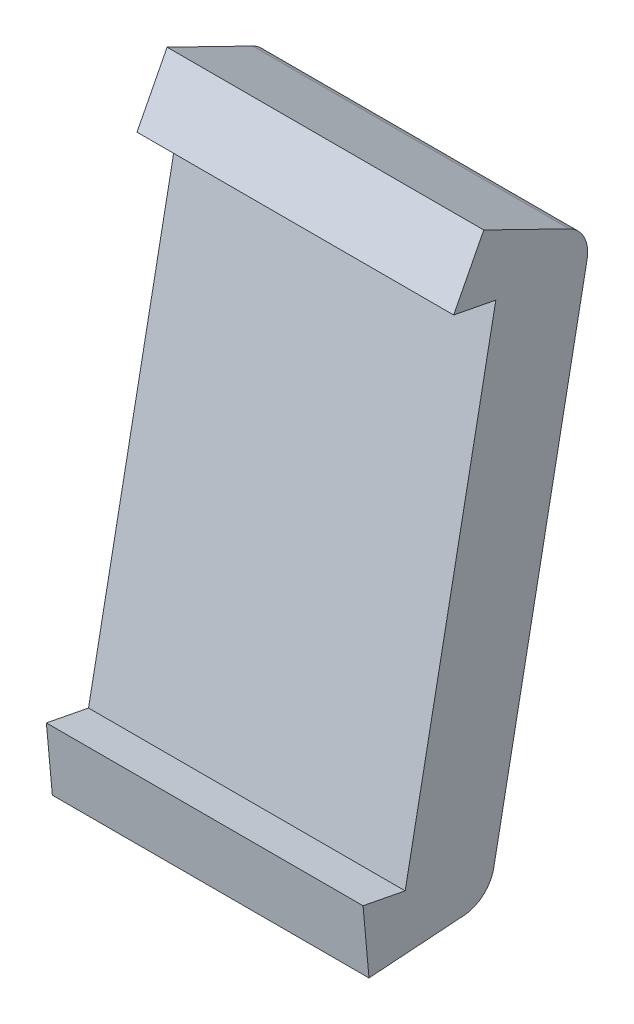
ISO-10303-21;
HEADER;
FILE_DESCRIPTION(('STEP AP214'),'2;1');
FILE_NAME('part.step','',(''),(''),'','','');
FILE_SCHEMA(('AUTOMOTIVE_DESIGN { 1 0 10303 214 1 1 1 1 }'));
ENDSEC;
DATA;
#1=APPLICATION_CONTEXT('core data for automotive mechanical design processes');
#2=APPLICATION_PROTOCOL_DEFINITION('international standard','automotive_design',2000,#1);
#3=PRODUCT_CONTEXT('',#1,'mechanical');
#4=PRODUCT('Part','Part','',(#3));
#5=PRODUCT_RELATED_PRODUCT_CATEGORY('part','',(#4));
#6=PRODUCT_DEFINITION_FORMATION('','',#4);
#7=PRODUCT_DEFINITION_CONTEXT('part definition',#1,'design');
#8=PRODUCT_DEFINITION('design','',#6,#7);
#9=PRODUCT_DEFINITION_SHAPE('','',#8);
#10=(LENGTH_UNIT() NAMED_UNIT(*) SI_UNIT(.MILLI.,.METRE.));
#11=(NAMED_UNIT(*) PLANE_ANGLE_UNIT() SI_UNIT($,.RADIAN.));
#12=(NAMED_UNIT(*) SI_UNIT($,.STERADIAN.) SOLID_ANGLE_UNIT());
#13=UNCERTAINTY_MEASURE_WITH_UNIT(LENGTH_MEASURE(1.E-05),#10,'distance_accuracy_value','');
#14=(GEOMETRIC_REPRESENTATION_CONTEXT(3) GLOBAL_UNCERTAINTY_ASSIGNED_CONTEXT((#13)) GLOBAL_UNIT_ASSIGNED_CONTEXT((#10,
#11,#12)) REPRESENTATION_CONTEXT('',''));
#15=CARTESIAN_POINT('',(0.,0.,0.));
#16=DIRECTION('',(0.,0.,1.));
#17=DIRECTION('',(1.,0.,0.));
#18=AXIS2_PLACEMENT_3D('',#15,#16,#17);
#19=CARTESIAN_POINT('',(-879.962960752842,-487.812084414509,-432.911668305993));
#20=DIRECTION('',(0.,0.190808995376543,0.981627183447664));
#21=DIRECTION('',(0.,-0.981627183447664,0.190808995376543));
#22=AXIS2_PLACEMENT_3D('',#19,#20,#21);
#23=PLANE('',#22);
#24=DIRECTION('',(0.,0.981627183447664,-0.190808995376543));
#25=VECTOR('',#24,1.);
#26=CARTESIAN_POINT('',(-849.228960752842,-487.812084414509,-432.911668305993));
#27=LINE('',#26,#25);
#28=CARTESIAN_POINT('',(-849.228960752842,-487.812084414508,-432.911668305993));
#29=VERTEX_POINT('',#28);
#30=CARTESIAN_POINT('',(-849.228960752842,-442.558089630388,-441.708153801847));
#31=VERTEX_POINT('',#30);
#32=EDGE_CURVE('E158',#29,#31,#27,.T.);
#33=ORIENTED_EDGE('',*,*,#32,.T.);
#34=DIRECTION('',(1.,0.,0.));
#35=VECTOR('',#34,1.);
#36=CARTESIAN_POINT('',(-879.962960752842,-442.558089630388,-441.708153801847));
#37=LINE('',#36,#35);
#38=CARTESIAN_POINT('',(-879.962960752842,-442.558089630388,-441.708153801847));
#39=VERTEX_POINT('',#38);
#40=EDGE_CURVE('E154',#39,#31,#37,.T.);
#41=ORIENTED_EDGE('',*,*,#40,.F.);
#42=DIRECTION('',(0.,0.981627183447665,-0.190808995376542));
#43=VECTOR('',#42,1.);
#44=CARTESIAN_POINT('',(-879.962960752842,-487.812084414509,-432.911668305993));
#45=LINE('',#44,#43);
#46=CARTESIAN_POINT('',(-879.962960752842,-487.812084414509,-432.911668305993));
#47=VERTEX_POINT('',#46);
#48=EDGE_CURVE('E184',#47,#39,#45,.T.);
#49=ORIENTED_EDGE('',*,*,#48,.F.);
#50=DIRECTION('',(1.,0.,0.));
#51=VECTOR('',#50,1.);
#52=CARTESIAN_POINT('',(-879.962960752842,-487.812084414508,-432.911668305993));
#53=LINE('',#52,#51);
#54=EDGE_CURVE('E107',#29,#47,#53,.F.);
#55=ORIENTED_EDGE('',*,*,#54,.F.);
#56=EDGE_LOOP('',(#33,#41,#49,#55));
#57=FACE_BOUND('',#56,.T.);
#58=ADVANCED_FACE('F17',(#57),#23,.T.);
#59=CARTESIAN_POINT('',(-879.962960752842,-442.558089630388,-441.708153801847));
#60=DIRECTION('',(0.,-0.981627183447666,0.190808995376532));
#61=DIRECTION('',(0.,-0.190808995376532,-0.981627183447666));
#62=AXIS2_PLACEMENT_3D('',#59,#60,#61);
#63=PLANE('',#62);
#64=DIRECTION('',(0.,0.190808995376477,0.981627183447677));
#65=VECTOR('',#64,1.);
#66=CARTESIAN_POINT('',(-849.228960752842,-442.558089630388,-441.708153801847));
#67=LINE('',#66,#65);
#68=CARTESIAN_POINT('',(-849.228960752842,-441.763143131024,-437.61850859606));
#69=VERTEX_POINT('',#68);
#70=EDGE_CURVE('E149',#31,#69,#67,.T.);
#71=ORIENTED_EDGE('',*,*,#70,.T.);
#72=DIRECTION('',(1.,0.,0.));
#73=VECTOR('',#72,1.);
#74=CARTESIAN_POINT('',(-879.962960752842,-441.763143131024,-437.61850859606));
#75=LINE('',#74,#73);
#76=CARTESIAN_POINT('',(-879.962960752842,-441.763143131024,-437.61850859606));
#77=VERTEX_POINT('',#76);
#78=EDGE_CURVE('E143',#77,#69,#75,.T.);
#79=ORIENTED_EDGE('',*,*,#78,.F.);
#80=DIRECTION('',(0.,0.190808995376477,0.981627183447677));
#81=VECTOR('',#80,1.);
#82=CARTESIAN_POINT('',(-879.962960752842,-442.558089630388,-441.708153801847));
#83=LINE('',#82,#81);
#84=EDGE_CURVE('E179',#39,#77,#83,.T.);
#85=ORIENTED_EDGE('',*,*,#84,.F.);
#86=ORIENTED_EDGE('',*,*,#40,.T.);
#87=EDGE_LOOP('',(#71,#79,#85,#86));
#88=FACE_BOUND('',#87,.T.);
#89=ADVANCED_FACE('F258',(#88),#63,.T.);
#90=CARTESIAN_POINT('',(-879.962960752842,-441.763143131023,-437.61850859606));
#91=DIRECTION('',(0.,0.45691068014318,0.889512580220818));
#92=DIRECTION('',(0.,-0.889512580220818,0.45691068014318));
#93=AXIS2_PLACEMENT_3D('',#90,#91,#92);
#94=PLANE('',#93);
#95=DIRECTION('',(0.,0.889512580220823,-0.45691068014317));
#96=VECTOR('',#95,1.);
#97=CARTESIAN_POINT('',(-849.228960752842,-441.763143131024,-437.61850859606));
#98=LINE('',#97,#96);
#99=CARTESIAN_POINT('',(-849.228960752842,-436.079553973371,-440.53796431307));
#100=VERTEX_POINT('',#99);
#101=EDGE_CURVE('E146',#69,#100,#98,.T.);
#102=ORIENTED_EDGE('',*,*,#101,.T.);
#103=DIRECTION('',(1.,0.,0.));
#104=VECTOR('',#103,1.);
#105=CARTESIAN_POINT('',(-879.962960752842,-436.079553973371,-440.53796431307));
#106=LINE('',#105,#104);
#107=CARTESIAN_POINT('',(-879.962960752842,-436.079553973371,-440.53796431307));
#108=VERTEX_POINT('',#107);
#109=EDGE_CURVE('E140',#108,#100,#106,.T.);
#110=ORIENTED_EDGE('',*,*,#109,.F.);
#111=DIRECTION('',(0.,0.889512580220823,-0.45691068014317));
#112=VECTOR('',#111,1.);
#113=CARTESIAN_POINT('',(-879.962960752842,-441.763143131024,-437.61850859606));
#114=LINE('',#113,#112);
#115=EDGE_CURVE('E175',#77,#108,#114,.T.);
#116=ORIENTED_EDGE('',*,*,#115,.F.);
#117=ORIENTED_EDGE('',*,*,#78,.T.);
#118=EDGE_LOOP('',(#102,#110,#116,#117));
#119=FACE_BOUND('',#118,.T.);
#120=ADVANCED_FACE('F224',(#119),#94,.T.);
#121=CARTESIAN_POINT('',(-879.962960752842,-436.079553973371,-440.53796431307));
#122=DIRECTION('',(0.,0.898662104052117,-0.438641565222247));
#123=DIRECTION('',(0.,0.438641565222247,0.898662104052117));
#124=AXIS2_PLACEMENT_3D('',#121,#122,#123);
#125=PLANE('',#124);
#126=DIRECTION('',(0.,-0.438641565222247,-0.898662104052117));
#127=VECTOR('',#126,1.);
#128=CARTESIAN_POINT('',(-849.228960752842,-436.079553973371,-440.53796431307));
#129=LINE('',#128,#127);
#130=CARTESIAN_POINT('',(-849.228960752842,-440.131735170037,-448.83982617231));
#131=VERTEX_POINT('',#130);
#132=EDGE_CURVE('E148',#100,#131,#129,.T.);
#133=ORIENTED_EDGE('',*,*,#132,.T.);
#134=DIRECTION('',(1.,0.,0.));
#135=VECTOR('',#134,1.);
#136=CARTESIAN_POINT('',(-879.962960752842,-440.131735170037,-448.83982617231));
#137=LINE('',#136,#135);
#138=CARTESIAN_POINT('',(-879.962960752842,-440.131735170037,-448.83982617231));
#139=VERTEX_POINT('',#138);
#140=EDGE_CURVE('E137',#139,#131,#137,.T.);
#141=ORIENTED_EDGE('',*,*,#140,.F.);
#142=DIRECTION('',(0.,-0.438641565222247,-0.898662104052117));
#143=VECTOR('',#142,1.);
#144=CARTESIAN_POINT('',(-879.962960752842,-436.079553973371,-440.53796431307));
#145=LINE('',#144,#143);
#146=EDGE_CURVE('E178',#108,#139,#145,.T.);
#147=ORIENTED_EDGE('',*,*,#146,.F.);
#148=ORIENTED_EDGE('',*,*,#109,.T.);
#149=EDGE_LOOP('',(#133,#141,#147,#148));
#150=FACE_BOUND('',#149,.T.);
#151=ADVANCED_FACE('F220',(#150),#125,.T.);
#152=CARTESIAN_POINT('',(-879.962960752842,-493.380517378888,-429.399785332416));
#153=DIRECTION('',(0.,-0.090422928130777,0.99590345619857));
#154=DIRECTION('',(0.,-0.99590345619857,-0.090422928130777));
#155=AXIS2_PLACEMENT_3D('',#152,#153,#154);
#156=PLANE('',#155);
#157=DIRECTION('',(0.,0.995903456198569,0.0904229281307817));
#158=VECTOR('',#157,1.);
#159=CARTESIAN_POINT('',(-849.228960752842,-493.380517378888,-429.399785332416));
#160=LINE('',#159,#158);
#161=CARTESIAN_POINT('',(-849.228960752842,-493.380517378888,-429.399785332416));
#162=VERTEX_POINT('',#161);
#163=CARTESIAN_POINT('',(-849.228960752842,-487.017137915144,-428.822023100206));
#164=VERTEX_POINT('',#163);
#165=EDGE_CURVE('E132',#162,#164,#160,.T.);
#166=ORIENTED_EDGE('',*,*,#165,.T.);
#167=DIRECTION('',(1.,0.,0.));
#168=VECTOR('',#167,1.);
#169=CARTESIAN_POINT('',(-879.962960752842,-487.017137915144,-428.822023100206));
#170=LINE('',#169,#168);
#171=CARTESIAN_POINT('',(-879.962960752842,-487.017137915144,-428.822023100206));
#172=VERTEX_POINT('',#171);
#173=EDGE_CURVE('E113',#172,#164,#170,.T.);
#174=ORIENTED_EDGE('',*,*,#173,.F.);
#175=DIRECTION('',(0.,0.995903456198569,0.0904229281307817));
#176=VECTOR('',#175,1.);
#177=CARTESIAN_POINT('',(-879.962960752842,-493.380517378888,-429.399785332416));
#178=LINE('',#177,#176);
#179=CARTESIAN_POINT('',(-879.962960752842,-493.380517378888,-429.399785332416));
#180=VERTEX_POINT('',#179);
#181=EDGE_CURVE('E110',#180,#172,#178,.T.);
#182=ORIENTED_EDGE('',*,*,#181,.F.);
#183=DIRECTION('',(1.,0.,0.));
#184=VECTOR('',#183,1.);
#185=CARTESIAN_POINT('',(-879.962960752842,-493.380517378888,-429.399785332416));
#186=LINE('',#185,#184);
#187=EDGE_CURVE('E101',#162,#180,#186,.F.);
#188=ORIENTED_EDGE('',*,*,#187,.F.);
#189=EDGE_LOOP('',(#166,#174,#182,#188));
#190=FACE_BOUND('',#189,.T.);
#191=ADVANCED_FACE('F111',(#190),#156,.T.);
#192=CARTESIAN_POINT('',(-879.962960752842,-487.017137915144,-428.822023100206));
#193=DIRECTION('',(0.,0.981627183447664,-0.190808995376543));
#194=DIRECTION('',(0.,0.190808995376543,0.981627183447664));
#195=AXIS2_PLACEMENT_3D('',#192,#193,#194);
#196=PLANE('',#195);
#197=DIRECTION('',(0.,-0.190808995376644,-0.981627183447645));
#198=VECTOR('',#197,1.);
#199=CARTESIAN_POINT('',(-849.228960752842,-487.017137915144,-428.822023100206));
#200=LINE('',#199,#198);
#201=EDGE_CURVE('E134',#164,#29,#200,.T.);
#202=ORIENTED_EDGE('',*,*,#201,.T.);
#203=ORIENTED_EDGE('',*,*,#54,.T.);
#204=DIRECTION('',(0.,-0.190808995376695,-0.981627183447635));
#205=VECTOR('',#204,1.);
#206=CARTESIAN_POINT('',(-879.962960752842,-487.017137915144,-428.822023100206));
#207=LINE('',#206,#205);
#208=EDGE_CURVE('E116',#172,#47,#207,.T.);
#209=ORIENTED_EDGE('',*,*,#208,.F.);
#210=ORIENTED_EDGE('',*,*,#173,.T.);
#211=EDGE_LOOP('',(#202,#203,#209,#210));
#212=FACE_BOUND('',#211,.T.);
#213=ADVANCED_FACE('F249',(#212),#196,.T.);
#214=CARTESIAN_POINT('',(-879.962960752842,-492.73333258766,-438.615111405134));
#215=DIRECTION('',(0.,-0.997543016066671,-0.0700566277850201));
#216=DIRECTION('',(0.,0.0700566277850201,-0.997543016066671));
#217=AXIS2_PLACEMENT_3D('',#214,#215,#216);
#218=PLANE('',#217);
#219=DIRECTION('',(0.,-0.0700566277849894,0.997543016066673));
#220=VECTOR('',#219,1.);
#221=CARTESIAN_POINT('',(-849.228960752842,-492.73333258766,-438.615111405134));
#222=LINE('',#221,#220);
#223=CARTESIAN_POINT('',(-849.228960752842,-492.73333258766,-438.615111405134));
#224=VERTEX_POINT('',#223);
#225=EDGE_CURVE('E104',#224,#162,#222,.T.);
#226=ORIENTED_EDGE('',*,*,#225,.T.);
#227=ORIENTED_EDGE('',*,*,#187,.T.);
#228=DIRECTION('',(0.,-0.0700566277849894,0.997543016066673));
#229=VECTOR('',#228,1.);
#230=CARTESIAN_POINT('',(-879.962960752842,-492.73333258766,-438.615111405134));
#231=LINE('',#230,#229);
#232=CARTESIAN_POINT('',(-879.962960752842,-492.73333258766,-438.615111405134));
#233=VERTEX_POINT('',#232);
#234=EDGE_CURVE('E67',#233,#180,#231,.T.);
#235=ORIENTED_EDGE('',*,*,#234,.F.);
#236=DIRECTION('',(1.,0.,0.));
#237=VECTOR('',#236,1.);
#238=CARTESIAN_POINT('',(-879.962960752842,-492.73333258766,-438.615111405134));
#239=LINE('',#238,#237);
#240=EDGE_CURVE('E128',#224,#233,#239,.F.);
#241=ORIENTED_EDGE('',*,*,#240,.F.);
#242=EDGE_LOOP('',(#226,#227,#235,#241));
#243=FACE_BOUND('',#242,.T.);
#244=ADVANCED_FACE('F103',(#243),#218,.T.);
#245=CARTESIAN_POINT('',(-879.962960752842,-465.729236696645,-440.1093184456));
#246=DIRECTION('',(-1.,0.,0.));
#247=DIRECTION('',(0.,-1.,0.));
#248=AXIS2_PLACEMENT_3D('',#245,#246,#247);
#249=PLANE('',#248);
#250=DIRECTION('',(0.,0.981627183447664,-0.190808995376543));
#251=VECTOR('',#250,1.);
#252=CARTESIAN_POINT('',(-879.962960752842,-443.590805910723,-450.563805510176));
#253=LINE('',#252,#251);
#254=CARTESIAN_POINT('',(-879.962960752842,-490.171952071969,-441.509347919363));
#255=VERTEX_POINT('',#254);
#256=CARTESIAN_POINT('',(-879.962960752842,-443.590805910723,-450.563805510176));
#257=VERTEX_POINT('',#256);
#258=EDGE_CURVE('E60',#255,#257,#253,.T.);
#259=ORIENTED_EDGE('',*,*,#258,.F.);
#260=CARTESIAN_POINT('',(-879.962960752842,-489.566133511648,-438.392681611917));
#261=DIRECTION('',(1.,0.,0.));
#262=DIRECTION('',(0.,0.,-1.));
#263=AXIS2_PLACEMENT_3D('',#260,#261,#262);
#264=CIRCLE('',#263,3.17499999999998);
#265=EDGE_CURVE('E119',#233,#255,#264,.T.);
#266=ORIENTED_EDGE('',*,*,#265,.F.);
#267=ORIENTED_EDGE('',*,*,#234,.T.);
#268=ORIENTED_EDGE('',*,*,#181,.T.);
#269=ORIENTED_EDGE('',*,*,#208,.T.);
#270=ORIENTED_EDGE('',*,*,#48,.T.);
#271=ORIENTED_EDGE('',*,*,#84,.T.);
#272=ORIENTED_EDGE('',*,*,#115,.T.);
#273=ORIENTED_EDGE('',*,*,#146,.T.);
#274=CARTESIAN_POINT('',(-879.962960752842,-442.984987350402,-447.447139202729));
#275=DIRECTION('',(1.,0.,0.));
#276=DIRECTION('',(0.,0.,-1.));
#277=AXIS2_PLACEMENT_3D('',#274,#275,#276);
#278=CIRCLE('',#277,3.17499999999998);
#279=EDGE_CURVE('E20',#257,#139,#278,.T.);
#280=ORIENTED_EDGE('',*,*,#279,.F.);
#281=EDGE_LOOP('',(#259,#266,#267,#268,#269,#270,#271,#272,#273,#280));
#282=FACE_BOUND('',#281,.T.);
#283=ADVANCED_FACE('F118',(#282),#249,.T.);
#284=CARTESIAN_POINT('',(-879.962960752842,-442.984987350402,-447.447139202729));
#285=DIRECTION('',(1.,0.,0.));
#286=DIRECTION('',(0.,0.,-1.));
#287=AXIS2_PLACEMENT_3D('',#284,#285,#286);
#288=CYLINDRICAL_SURFACE('',#287,3.17499999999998);
#289=CARTESIAN_POINT('',(-849.228960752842,-442.984987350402,-447.447139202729));
#290=DIRECTION('',(1.,0.,0.));
#291=DIRECTION('',(0.,0.,-1.));
#292=AXIS2_PLACEMENT_3D('',#289,#290,#291);
#293=CIRCLE('',#292,3.17499999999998);
#294=CARTESIAN_POINT('',(-849.228960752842,-443.590805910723,-450.563805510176));
#295=VERTEX_POINT('',#294);
#296=EDGE_CURVE('E200',#131,#295,#293,.F.);
#297=ORIENTED_EDGE('',*,*,#296,.T.);
#298=DIRECTION('',(1.,0.,0.));
#299=VECTOR('',#298,1.);
#300=CARTESIAN_POINT('',(-879.962960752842,-443.590805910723,-450.563805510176));
#301=LINE('',#300,#299);
#302=EDGE_CURVE('E213',#257,#295,#301,.T.);
#303=ORIENTED_EDGE('',*,*,#302,.F.);
#304=ORIENTED_EDGE('',*,*,#279,.T.);
#305=ORIENTED_EDGE('',*,*,#140,.T.);
#306=EDGE_LOOP('',(#297,#303,#304,#305));
#307=FACE_BOUND('',#306,.T.);
#308=ADVANCED_FACE('F219',(#307),#288,.T.);
#309=CARTESIAN_POINT('',(-849.228960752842,-487.812084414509,-432.911668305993));
#310=DIRECTION('',(-1.,0.,0.));
#311=DIRECTION('',(0.,-1.,0.));
#312=AXIS2_PLACEMENT_3D('',#309,#310,#311);
#313=PLANE('',#312);
#314=ORIENTED_EDGE('',*,*,#165,.F.);
#315=ORIENTED_EDGE('',*,*,#225,.F.);
#316=CARTESIAN_POINT('',(-849.228960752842,-489.566133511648,-438.392681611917));
#317=DIRECTION('',(1.,0.,0.));
#318=DIRECTION('',(0.,0.,-1.));
#319=AXIS2_PLACEMENT_3D('',#316,#317,#318);
#320=CIRCLE('',#319,3.17499999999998);
#321=CARTESIAN_POINT('',(-849.228960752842,-490.171952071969,-441.509347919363));
#322=VERTEX_POINT('',#321);
#323=EDGE_CURVE('E35',#322,#224,#320,.F.);
#324=ORIENTED_EDGE('',*,*,#323,.F.);
#325=DIRECTION('',(0.,0.981627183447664,-0.190808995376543));
#326=VECTOR('',#325,1.);
#327=CARTESIAN_POINT('',(-849.228960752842,-443.590805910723,-450.563805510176));
#328=LINE('',#327,#326);
#329=EDGE_CURVE('E26',#295,#322,#328,.F.);
#330=ORIENTED_EDGE('',*,*,#329,.F.);
#331=ORIENTED_EDGE('',*,*,#296,.F.);
#332=ORIENTED_EDGE('',*,*,#132,.F.);
#333=ORIENTED_EDGE('',*,*,#101,.F.);
#334=ORIENTED_EDGE('',*,*,#70,.F.);
#335=ORIENTED_EDGE('',*,*,#32,.F.);
#336=ORIENTED_EDGE('',*,*,#201,.F.);
#337=EDGE_LOOP('',(#314,#315,#324,#330,#331,#332,#333,#334,#335,#336));
#338=FACE_BOUND('',#337,.T.);
#339=ADVANCED_FACE('F227',(#338),#313,.F.);
#340=CARTESIAN_POINT('',(-879.962960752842,-489.566133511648,-438.392681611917));
#341=DIRECTION('',(1.,0.,0.));
#342=DIRECTION('',(0.,0.,-1.));
#343=AXIS2_PLACEMENT_3D('',#340,#341,#342);
#344=CYLINDRICAL_SURFACE('',#343,3.17499999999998);
#345=ORIENTED_EDGE('',*,*,#240,.T.);
#346=ORIENTED_EDGE('',*,*,#265,.T.);
#347=DIRECTION('',(1.,0.,0.));
#348=VECTOR('',#347,1.);
#349=CARTESIAN_POINT('',(-879.962960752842,-490.171952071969,-441.509347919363));
#350=LINE('',#349,#348);
#351=EDGE_CURVE('E11',#322,#255,#350,.F.);
#352=ORIENTED_EDGE('',*,*,#351,.F.);
#353=ORIENTED_EDGE('',*,*,#323,.T.);
#354=EDGE_LOOP('',(#345,#346,#352,#353));
#355=FACE_BOUND('',#354,.T.);
#356=ADVANCED_FACE('F232',(#355),#344,.T.);
#357=CARTESIAN_POINT('',(-879.962960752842,-443.590805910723,-450.563805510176));
#358=DIRECTION('',(0.,-0.190808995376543,-0.981627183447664));
#359=DIRECTION('',(0.,0.981627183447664,-0.190808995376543));
#360=AXIS2_PLACEMENT_3D('',#357,#358,#359);
#361=PLANE('',#360);
#362=ORIENTED_EDGE('',*,*,#329,.T.);
#363=ORIENTED_EDGE('',*,*,#351,.T.);
#364=ORIENTED_EDGE('',*,*,#258,.T.);
#365=ORIENTED_EDGE('',*,*,#302,.T.);
#366=EDGE_LOOP('',(#362,#363,#364,#365));
#367=FACE_BOUND('',#366,.T.);
#368=ADVANCED_FACE('F230',(#367),#361,.T.);
#369=CLOSED_SHELL('',(#58,#89,#120,#151,#191,#213,#244,#283,#308,#339,#356,#368));
#370=MANIFOLD_SOLID_BREP('B1',#369);
#371=ADVANCED_BREP_SHAPE_REPRESENTATION('',(#18,#370),#14);
#372=SHAPE_DEFINITION_REPRESENTATION(#9,#371);
ENDSEC;
END-ISO-10303-21;
